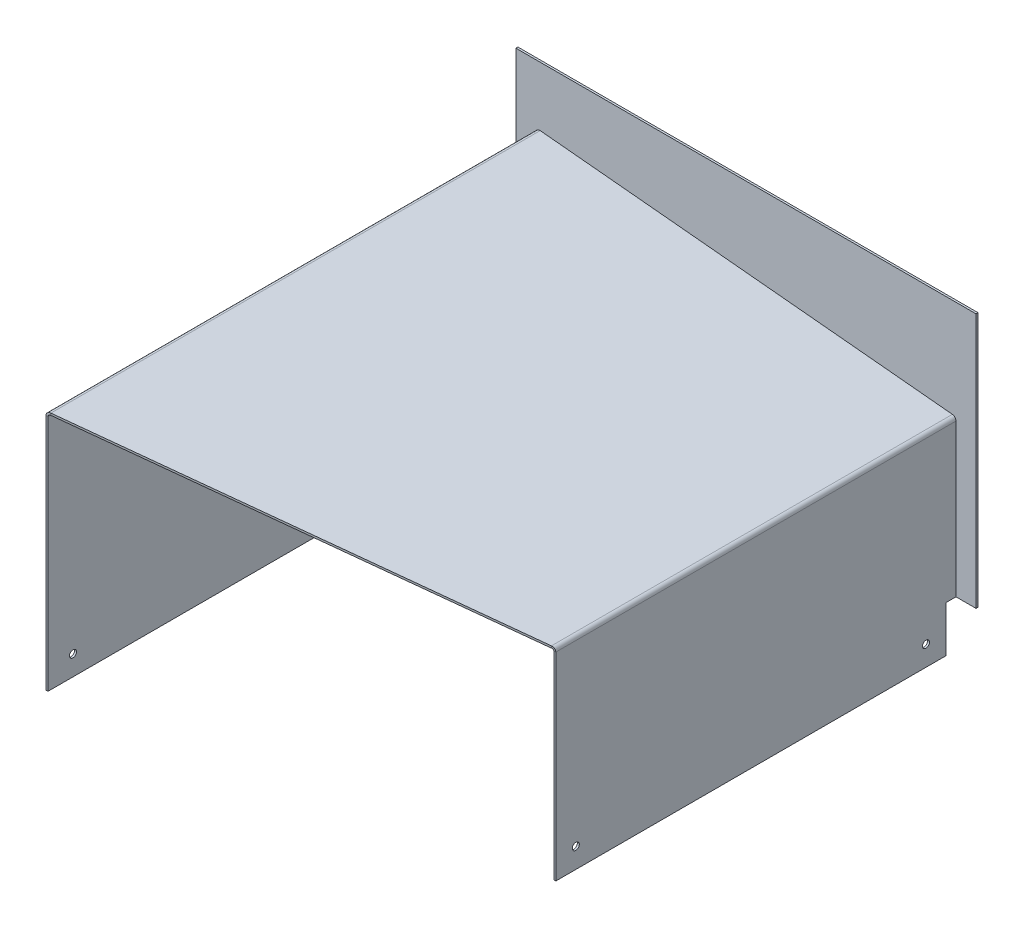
ISO-10303-21;
HEADER;
FILE_DESCRIPTION(('STEP AP214'),'2;1');
FILE_NAME('part.step','',(''),(''),'','','');
FILE_SCHEMA(('AUTOMOTIVE_DESIGN { 1 0 10303 214 1 1 1 1 }'));
ENDSEC;
DATA;
#1=APPLICATION_CONTEXT('core data for automotive mechanical design processes');
#2=APPLICATION_PROTOCOL_DEFINITION('international standard','automotive_design',2000,#1);
#3=PRODUCT_CONTEXT('',#1,'mechanical');
#4=PRODUCT('Part','Part','',(#3));
#5=PRODUCT_RELATED_PRODUCT_CATEGORY('part','',(#4));
#6=PRODUCT_DEFINITION_FORMATION('','',#4);
#7=PRODUCT_DEFINITION_CONTEXT('part definition',#1,'design');
#8=PRODUCT_DEFINITION('design','',#6,#7);
#9=PRODUCT_DEFINITION_SHAPE('','',#8);
#10=(LENGTH_UNIT() NAMED_UNIT(*) SI_UNIT(.MILLI.,.METRE.));
#11=(NAMED_UNIT(*) PLANE_ANGLE_UNIT() SI_UNIT($,.RADIAN.));
#12=(NAMED_UNIT(*) SI_UNIT($,.STERADIAN.) SOLID_ANGLE_UNIT());
#13=UNCERTAINTY_MEASURE_WITH_UNIT(LENGTH_MEASURE(1.E-05),#10,'distance_accuracy_value','');
#14=(GEOMETRIC_REPRESENTATION_CONTEXT(3) GLOBAL_UNCERTAINTY_ASSIGNED_CONTEXT((#13)) GLOBAL_UNIT_ASSIGNED_CONTEXT((#10,
#11,#12)) REPRESENTATION_CONTEXT('',''));
#15=CARTESIAN_POINT('',(0.,0.,0.));
#16=DIRECTION('',(0.,0.,1.));
#17=DIRECTION('',(1.,0.,0.));
#18=AXIS2_PLACEMENT_3D('',#15,#16,#17);
#19=CARTESIAN_POINT('',(416.,200.,490.));
#20=DIRECTION('',(1.,0.,0.));
#21=DIRECTION('',(0.,1.,0.));
#22=AXIS2_PLACEMENT_3D('',#19,#20,#21);
#23=PLANE('',#22);
#24=CARTESIAN_POINT('',(416.,20.0000000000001,380.));
#25=DIRECTION('',(1.,0.,0.));
#26=DIRECTION('',(0.,1.,0.));
#27=AXIS2_PLACEMENT_3D('',#24,#25,#26);
#28=CIRCLE('',#27,3.49999999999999);
#29=CARTESIAN_POINT('',(416.,23.5000000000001,380.));
#30=VERTEX_POINT('',#29);
#31=EDGE_CURVE('E388',#30,#30,#28,.T.);
#32=ORIENTED_EDGE('',*,*,#31,.T.);
#33=EDGE_LOOP('',(#32));
#34=FACE_BOUND('',#33,.T.);
#35=CARTESIAN_POINT('',(416.,20.0000000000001,30.));
#36=DIRECTION('',(1.,0.,0.));
#37=DIRECTION('',(0.,1.,0.));
#38=AXIS2_PLACEMENT_3D('',#35,#36,#37);
#39=CIRCLE('',#38,3.49999999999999);
#40=CARTESIAN_POINT('',(416.,23.5000000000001,30.));
#41=VERTEX_POINT('',#40);
#42=EDGE_CURVE('E391',#41,#41,#39,.T.);
#43=ORIENTED_EDGE('',*,*,#42,.T.);
#44=EDGE_LOOP('',(#43));
#45=FACE_BOUND('',#44,.T.);
#46=DIRECTION('',(0.,0.,1.));
#47=VECTOR('',#46,1.);
#48=CARTESIAN_POINT('',(416.,45.9999999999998,490.));
#49=LINE('',#48,#47);
#50=CARTESIAN_POINT('',(416.,45.9999999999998,-2.));
#51=VERTEX_POINT('',#50);
#52=CARTESIAN_POINT('',(416.,45.9999999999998,10.));
#53=VERTEX_POINT('',#52);
#54=EDGE_CURVE('E290',#51,#53,#49,.T.);
#55=ORIENTED_EDGE('',*,*,#54,.T.);
#56=DIRECTION('',(0.,-1.,0.));
#57=VECTOR('',#56,1.);
#58=CARTESIAN_POINT('',(416.,200.,10.));
#59=LINE('',#58,#57);
#60=CARTESIAN_POINT('',(416.,-2.3215103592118E-13,10.));
#61=VERTEX_POINT('',#60);
#62=EDGE_CURVE('E292',#53,#61,#59,.T.);
#63=ORIENTED_EDGE('',*,*,#62,.T.);
#64=DIRECTION('',(0.,0.,-1.));
#65=VECTOR('',#64,1.);
#66=CARTESIAN_POINT('',(416.,0.,490.));
#67=LINE('',#66,#65);
#68=CARTESIAN_POINT('',(416.,9.43689570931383E-13,400.));
#69=VERTEX_POINT('',#68);
#70=EDGE_CURVE('E42',#69,#61,#67,.T.);
#71=ORIENTED_EDGE('',*,*,#70,.F.);
#72=DIRECTION('',(0.,1.,0.));
#73=VECTOR('',#72,1.);
#74=CARTESIAN_POINT('',(416.,200.,400.));
#75=LINE('',#74,#73);
#76=CARTESIAN_POINT('',(416.,198.18308340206,400.));
#77=VERTEX_POINT('',#76);
#78=EDGE_CURVE('E208',#77,#69,#75,.F.);
#79=ORIENTED_EDGE('',*,*,#78,.F.);
#80=DIRECTION('',(0.,0.,-1.));
#81=VECTOR('',#80,1.);
#82=CARTESIAN_POINT('',(416.,198.18308340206,490.));
#83=LINE('',#82,#81);
#84=CARTESIAN_POINT('',(416.,198.18308340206,-2.));
#85=VERTEX_POINT('',#84);
#86=EDGE_CURVE('E202',#77,#85,#83,.T.);
#87=ORIENTED_EDGE('',*,*,#86,.T.);
#88=DIRECTION('',(0.,1.,0.));
#89=VECTOR('',#88,1.);
#90=CARTESIAN_POINT('',(416.,198.18308340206,-2.));
#91=LINE('',#90,#89);
#92=EDGE_CURVE('E206',#51,#85,#91,.T.);
#93=ORIENTED_EDGE('',*,*,#92,.F.);
#94=EDGE_LOOP('',(#55,#63,#71,#79,#87,#93));
#95=FACE_BOUND('',#94,.T.);
#96=ADVANCED_FACE('F35',(#34,#45,#95),#23,.F.);
#97=CARTESIAN_POINT('',(418.,0.,490.));
#98=DIRECTION('',(0.,-1.,0.));
#99=DIRECTION('',(1.,0.,0.));
#100=AXIS2_PLACEMENT_3D('',#97,#98,#99);
#101=PLANE('',#100);
#102=DIRECTION('',(1.,0.,0.));
#103=VECTOR('',#102,1.);
#104=CARTESIAN_POINT('',(-2.00000000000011,0.,10.));
#105=LINE('',#104,#103);
#106=CARTESIAN_POINT('',(418.,-2.33261258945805E-13,10.));
#107=VERTEX_POINT('',#106);
#108=EDGE_CURVE('E285',#61,#107,#105,.T.);
#109=ORIENTED_EDGE('',*,*,#108,.T.);
#110=DIRECTION('',(0.,0.,-1.));
#111=VECTOR('',#110,1.);
#112=CARTESIAN_POINT('',(418.,0.,490.));
#113=LINE('',#112,#111);
#114=CARTESIAN_POINT('',(418.,9.54261476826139E-13,400.));
#115=VERTEX_POINT('',#114);
#116=EDGE_CURVE('E437',#115,#107,#113,.T.);
#117=ORIENTED_EDGE('',*,*,#116,.F.);
#118=DIRECTION('',(1.,0.,0.));
#119=VECTOR('',#118,1.);
#120=CARTESIAN_POINT('',(418.,9.54261476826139E-13,400.));
#121=LINE('',#120,#119);
#122=EDGE_CURVE('E67',#115,#69,#121,.F.);
#123=ORIENTED_EDGE('',*,*,#122,.T.);
#124=ORIENTED_EDGE('',*,*,#70,.T.);
#125=EDGE_LOOP('',(#109,#117,#123,#124));
#126=FACE_BOUND('',#125,.T.);
#127=ADVANCED_FACE('F378',(#126),#101,.T.);
#128=CARTESIAN_POINT('',(418.,200.,490.));
#129=DIRECTION('',(1.,0.,0.));
#130=DIRECTION('',(0.,1.,0.));
#131=AXIS2_PLACEMENT_3D('',#128,#129,#130);
#132=PLANE('',#131);
#133=DIRECTION('',(0.,-1.,0.));
#134=VECTOR('',#133,1.);
#135=CARTESIAN_POINT('',(418.,-2.33261258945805E-13,10.));
#136=LINE('',#135,#134);
#137=CARTESIAN_POINT('',(418.,45.9999999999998,10.));
#138=VERTEX_POINT('',#137);
#139=EDGE_CURVE('E274',#138,#107,#136,.T.);
#140=ORIENTED_EDGE('',*,*,#139,.F.);
#141=DIRECTION('',(0.,0.,1.));
#142=VECTOR('',#141,1.);
#143=CARTESIAN_POINT('',(418.,45.9999999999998,0.));
#144=LINE('',#143,#142);
#145=CARTESIAN_POINT('',(418.,45.9999999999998,0.));
#146=VERTEX_POINT('',#145);
#147=EDGE_CURVE('E269',#146,#138,#144,.T.);
#148=ORIENTED_EDGE('',*,*,#147,.F.);
#149=DIRECTION('',(0.,-1.,0.));
#150=VECTOR('',#149,1.);
#151=CARTESIAN_POINT('',(418.,200.,0.));
#152=LINE('',#151,#150);
#153=CARTESIAN_POINT('',(418.,198.18308340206,0.));
#154=VERTEX_POINT('',#153);
#155=EDGE_CURVE('E404',#154,#146,#152,.T.);
#156=ORIENTED_EDGE('',*,*,#155,.F.);
#157=DIRECTION('',(0.,0.,-1.));
#158=VECTOR('',#157,1.);
#159=CARTESIAN_POINT('',(418.,198.18308340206,490.));
#160=LINE('',#159,#158);
#161=CARTESIAN_POINT('',(417.999999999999,198.18308340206,400.));
#162=VERTEX_POINT('',#161);
#163=EDGE_CURVE('E434',#162,#154,#160,.T.);
#164=ORIENTED_EDGE('',*,*,#163,.F.);
#165=DIRECTION('',(0.,-1.,0.));
#166=VECTOR('',#165,1.);
#167=CARTESIAN_POINT('',(417.999999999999,241.798468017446,400.));
#168=LINE('',#167,#166);
#169=EDGE_CURVE('E450',#162,#115,#168,.T.);
#170=ORIENTED_EDGE('',*,*,#169,.T.);
#171=ORIENTED_EDGE('',*,*,#116,.T.);
#172=EDGE_LOOP('',(#140,#148,#156,#164,#170,#171));
#173=FACE_BOUND('',#172,.T.);
#174=CARTESIAN_POINT('',(418.,20.0000000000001,380.));
#175=DIRECTION('',(1.,0.,0.));
#176=DIRECTION('',(0.,0.,-1.));
#177=AXIS2_PLACEMENT_3D('',#174,#175,#176);
#178=CIRCLE('',#177,3.49999999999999);
#179=CARTESIAN_POINT('',(418.,20.0000000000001,376.5));
#180=VERTEX_POINT('',#179);
#181=EDGE_CURVE('E393',#180,#180,#178,.T.);
#182=ORIENTED_EDGE('',*,*,#181,.F.);
#183=EDGE_LOOP('',(#182));
#184=FACE_BOUND('',#183,.T.);
#185=CARTESIAN_POINT('',(418.,20.0000000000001,30.));
#186=DIRECTION('',(1.,0.,0.));
#187=DIRECTION('',(0.,0.,-1.));
#188=AXIS2_PLACEMENT_3D('',#185,#186,#187);
#189=CIRCLE('',#188,3.49999999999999);
#190=CARTESIAN_POINT('',(418.,20.0000000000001,26.5));
#191=VERTEX_POINT('',#190);
#192=EDGE_CURVE('E394',#191,#191,#189,.T.);
#193=ORIENTED_EDGE('',*,*,#192,.F.);
#194=EDGE_LOOP('',(#193));
#195=FACE_BOUND('',#194,.T.);
#196=ADVANCED_FACE('F383',(#173,#184,#195),#132,.T.);
#197=CARTESIAN_POINT('',(414.,198.18308340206,490.));
#198=DIRECTION('',(0.,0.,-1.));
#199=DIRECTION('',(-1.,0.,0.));
#200=AXIS2_PLACEMENT_3D('',#197,#198,#199);
#201=CYLINDRICAL_SURFACE('',#200,4.);
#202=DIRECTION('',(0.,0.,-1.));
#203=VECTOR('',#202,1.);
#204=CARTESIAN_POINT('',(414.382849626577,202.164719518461,490.));
#205=LINE('',#204,#203);
#206=CARTESIAN_POINT('',(414.382849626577,202.164719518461,400.775103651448));
#207=VERTEX_POINT('',#206);
#208=CARTESIAN_POINT('',(414.382849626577,202.164719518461,0.));
#209=VERTEX_POINT('',#208);
#210=EDGE_CURVE('E431',#207,#209,#205,.T.);
#211=ORIENTED_EDGE('',*,*,#210,.F.);
#212=CARTESIAN_POINT('',(414.,198.18308340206,400.857142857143));
#213=DIRECTION('',(-0.209529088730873,0.,-0.97780241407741));
#214=DIRECTION('',(0.97780241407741,0.,-0.209529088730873));
#215=AXIS2_PLACEMENT_3D('',#212,#213,#214);
#216=ELLIPSE('',#215,4.09080601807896,4.);
#217=EDGE_CURVE('E295',#162,#207,#216,.F.);
#218=ORIENTED_EDGE('',*,*,#217,.F.);
#219=ORIENTED_EDGE('',*,*,#163,.T.);
#220=CARTESIAN_POINT('',(414.,198.18308340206,0.));
#221=DIRECTION('',(0.,0.,1.));
#222=DIRECTION('',(1.,0.,0.));
#223=AXIS2_PLACEMENT_3D('',#220,#221,#222);
#224=CIRCLE('',#223,4.);
#225=EDGE_CURVE('E407',#209,#154,#224,.F.);
#226=ORIENTED_EDGE('',*,*,#225,.F.);
#227=EDGE_LOOP('',(#211,#218,#219,#226));
#228=FACE_BOUND('',#227,.T.);
#229=ADVANCED_FACE('F470',(#228),#201,.T.);
#230=CARTESIAN_POINT('',(416.191424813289,201.990818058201,490.));
#231=DIRECTION('',(0.0957124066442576,0.995409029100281,0.));
#232=DIRECTION('',(-0.995409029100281,0.0957124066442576,0.));
#233=AXIS2_PLACEMENT_3D('',#230,#231,#232);
#234=PLANE('',#233);
#235=DIRECTION('',(0.,0.,-1.));
#236=VECTOR('',#235,1.);
#237=CARTESIAN_POINT('',(2.3828496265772,241.780104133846,490.));
#238=LINE('',#237,#236);
#239=CARTESIAN_POINT('',(2.3828496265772,241.780104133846,489.060817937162));
#240=VERTEX_POINT('',#239);
#241=CARTESIAN_POINT('',(2.3828496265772,241.780104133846,0.));
#242=VERTEX_POINT('',#241);
#243=EDGE_CURVE('E428',#240,#242,#238,.T.);
#244=ORIENTED_EDGE('',*,*,#243,.F.);
#245=DIRECTION('',(-0.973509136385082,0.0936066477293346,0.208609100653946));
#246=VECTOR('',#245,1.);
#247=CARTESIAN_POINT('',(397.992672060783,203.740698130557,404.287284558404));
#248=LINE('',#247,#246);
#249=EDGE_CURVE('E74',#207,#240,#248,.T.);
#250=ORIENTED_EDGE('',*,*,#249,.F.);
#251=ORIENTED_EDGE('',*,*,#210,.T.);
#252=DIRECTION('',(0.995409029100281,-0.0957124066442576,0.));
#253=VECTOR('',#252,1.);
#254=CARTESIAN_POINT('',(416.191424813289,201.990818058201,0.));
#255=LINE('',#254,#253);
#256=EDGE_CURVE('E409',#242,#209,#255,.T.);
#257=ORIENTED_EDGE('',*,*,#256,.F.);
#258=EDGE_LOOP('',(#244,#250,#251,#257));
#259=FACE_BOUND('',#258,.T.);
#260=ADVANCED_FACE('F466',(#259),#234,.T.);
#261=CARTESIAN_POINT('',(2.,237.798468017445,490.));
#262=DIRECTION('',(0.,0.,-1.));
#263=DIRECTION('',(-1.,0.,0.));
#264=AXIS2_PLACEMENT_3D('',#261,#262,#263);
#265=CYLINDRICAL_SURFACE('',#264,4.);
#266=DIRECTION('',(0.,0.,-1.));
#267=VECTOR('',#266,1.);
#268=CARTESIAN_POINT('',(-2.,237.798468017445,490.));
#269=LINE('',#268,#267);
#270=CARTESIAN_POINT('',(-2.,237.798468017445,489.571428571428));
#271=VERTEX_POINT('',#270);
#272=CARTESIAN_POINT('',(-2.,237.798468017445,0.));
#273=VERTEX_POINT('',#272);
#274=EDGE_CURVE('E425',#271,#273,#269,.T.);
#275=ORIENTED_EDGE('',*,*,#274,.F.);
#276=CARTESIAN_POINT('',(2.,237.798468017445,489.142857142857));
#277=DIRECTION('',(-0.106533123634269,0.,-0.994309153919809));
#278=DIRECTION('',(0.994309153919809,0.,-0.106533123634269));
#279=AXIS2_PLACEMENT_3D('',#276,#277,#278);
#280=ELLIPSE('',#279,4.02289366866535,4.);
#281=CARTESIAN_POINT('',(2.00000000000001,241.798468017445,489.142857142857));
#282=VERTEX_POINT('',#281);
#283=EDGE_CURVE('E310',#282,#271,#280,.F.);
#284=ORIENTED_EDGE('',*,*,#283,.F.);
#285=CARTESIAN_POINT('',(2.,237.798468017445,489.142857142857));
#286=DIRECTION('',(-0.209529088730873,0.,-0.97780241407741));
#287=DIRECTION('',(0.97780241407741,0.,-0.209529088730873));
#288=AXIS2_PLACEMENT_3D('',#285,#286,#287);
#289=ELLIPSE('',#288,4.09080601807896,4.);
#290=EDGE_CURVE('E99',#240,#282,#289,.F.);
#291=ORIENTED_EDGE('',*,*,#290,.F.);
#292=ORIENTED_EDGE('',*,*,#243,.T.);
#293=CARTESIAN_POINT('',(2.,237.798468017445,0.));
#294=DIRECTION('',(0.,0.,1.));
#295=DIRECTION('',(1.,0.,0.));
#296=AXIS2_PLACEMENT_3D('',#293,#294,#295);
#297=CIRCLE('',#296,4.);
#298=EDGE_CURVE('E411',#273,#242,#297,.F.);
#299=ORIENTED_EDGE('',*,*,#298,.F.);
#300=EDGE_LOOP('',(#275,#284,#291,#292,#299));
#301=FACE_BOUND('',#300,.T.);
#302=ADVANCED_FACE('F475',(#301),#265,.T.);
#303=CARTESIAN_POINT('',(-2.,0.,490.));
#304=DIRECTION('',(-1.,0.,0.));
#305=DIRECTION('',(0.,0.,1.));
#306=AXIS2_PLACEMENT_3D('',#303,#304,#305);
#307=PLANE('',#306);
#308=CARTESIAN_POINT('',(-2.,20.0000000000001,464.571428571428));
#309=DIRECTION('',(-1.,0.,0.));
#310=DIRECTION('',(0.,0.,1.));
#311=AXIS2_PLACEMENT_3D('',#308,#309,#310);
#312=CIRCLE('',#311,3.49999999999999);
#313=CARTESIAN_POINT('',(-2.,20.0000000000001,468.071428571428));
#314=VERTEX_POINT('',#313);
#315=EDGE_CURVE('E803',#314,#314,#312,.T.);
#316=ORIENTED_EDGE('',*,*,#315,.F.);
#317=EDGE_LOOP('',(#316));
#318=FACE_BOUND('',#317,.T.);
#319=CARTESIAN_POINT('',(-2.,20.0000000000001,30.));
#320=DIRECTION('',(-1.,0.,0.));
#321=DIRECTION('',(0.,0.,1.));
#322=AXIS2_PLACEMENT_3D('',#319,#320,#321);
#323=CIRCLE('',#322,3.49999999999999);
#324=CARTESIAN_POINT('',(-2.,20.0000000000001,33.5));
#325=VERTEX_POINT('',#324);
#326=EDGE_CURVE('E806',#325,#325,#323,.T.);
#327=ORIENTED_EDGE('',*,*,#326,.F.);
#328=EDGE_LOOP('',(#327));
#329=FACE_BOUND('',#328,.T.);
#330=DIRECTION('',(0.,-1.,0.));
#331=VECTOR('',#330,1.);
#332=CARTESIAN_POINT('',(-2.00000000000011,0.,10.));
#333=LINE('',#332,#331);
#334=CARTESIAN_POINT('',(-2.00000000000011,46.,10.));
#335=VERTEX_POINT('',#334);
#336=CARTESIAN_POINT('',(-2.00000000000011,0.,10.));
#337=VERTEX_POINT('',#336);
#338=EDGE_CURVE('E273',#335,#337,#333,.T.);
#339=ORIENTED_EDGE('',*,*,#338,.T.);
#340=DIRECTION('',(0.,0.,-1.));
#341=VECTOR('',#340,1.);
#342=CARTESIAN_POINT('',(-2.,0.,490.));
#343=LINE('',#342,#341);
#344=CARTESIAN_POINT('',(-2.,0.,489.571428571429));
#345=VERTEX_POINT('',#344);
#346=EDGE_CURVE('E422',#345,#337,#343,.T.);
#347=ORIENTED_EDGE('',*,*,#346,.F.);
#348=DIRECTION('',(0.,1.,0.));
#349=VECTOR('',#348,1.);
#350=CARTESIAN_POINT('',(-2.,0.,489.571428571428));
#351=LINE('',#350,#349);
#352=EDGE_CURVE('E83',#271,#345,#351,.F.);
#353=ORIENTED_EDGE('',*,*,#352,.F.);
#354=ORIENTED_EDGE('',*,*,#274,.T.);
#355=DIRECTION('',(0.,1.,0.));
#356=VECTOR('',#355,1.);
#357=CARTESIAN_POINT('',(-2.,0.,0.));
#358=LINE('',#357,#356);
#359=CARTESIAN_POINT('',(-2.00000000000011,46.,0.));
#360=VERTEX_POINT('',#359);
#361=EDGE_CURVE('E211',#360,#273,#358,.T.);
#362=ORIENTED_EDGE('',*,*,#361,.F.);
#363=DIRECTION('',(0.,0.,1.));
#364=VECTOR('',#363,1.);
#365=CARTESIAN_POINT('',(-2.00000000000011,46.,0.));
#366=LINE('',#365,#364);
#367=EDGE_CURVE('E270',#360,#335,#366,.T.);
#368=ORIENTED_EDGE('',*,*,#367,.T.);
#369=EDGE_LOOP('',(#339,#347,#353,#354,#362,#368));
#370=FACE_BOUND('',#369,.T.);
#371=ADVANCED_FACE('F502',(#318,#329,#370),#307,.T.);
#372=CARTESIAN_POINT('',(0.,0.,490.));
#373=DIRECTION('',(0.,-1.,0.));
#374=DIRECTION('',(0.,0.,-1.));
#375=AXIS2_PLACEMENT_3D('',#372,#373,#374);
#376=PLANE('',#375);
#377=CARTESIAN_POINT('',(0.,0.,10.));
#378=VERTEX_POINT('',#377);
#379=EDGE_CURVE('E281',#337,#378,#105,.T.);
#380=ORIENTED_EDGE('',*,*,#379,.T.);
#381=DIRECTION('',(0.,0.,-1.));
#382=VECTOR('',#381,1.);
#383=CARTESIAN_POINT('',(0.,0.,490.));
#384=LINE('',#383,#382);
#385=CARTESIAN_POINT('',(0.,0.,489.571428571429));
#386=VERTEX_POINT('',#385);
#387=EDGE_CURVE('E419',#386,#378,#384,.T.);
#388=ORIENTED_EDGE('',*,*,#387,.F.);
#389=DIRECTION('',(1.,0.,0.));
#390=VECTOR('',#389,1.);
#391=CARTESIAN_POINT('',(0.,0.,489.571428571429));
#392=LINE('',#391,#390);
#393=EDGE_CURVE('E92',#386,#345,#392,.F.);
#394=ORIENTED_EDGE('',*,*,#393,.T.);
#395=ORIENTED_EDGE('',*,*,#346,.T.);
#396=EDGE_LOOP('',(#380,#388,#394,#395));
#397=FACE_BOUND('',#396,.T.);
#398=ADVANCED_FACE('F513',(#397),#376,.T.);
#399=CARTESIAN_POINT('',(0.,0.,490.));
#400=DIRECTION('',(-1.,0.,0.));
#401=DIRECTION('',(0.,0.,1.));
#402=AXIS2_PLACEMENT_3D('',#399,#400,#401);
#403=PLANE('',#402);
#404=CARTESIAN_POINT('',(0.,20.0000000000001,464.571428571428));
#405=DIRECTION('',(-1.,0.,0.));
#406=DIRECTION('',(0.,0.,1.));
#407=AXIS2_PLACEMENT_3D('',#404,#405,#406);
#408=CIRCLE('',#407,3.49999999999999);
#409=CARTESIAN_POINT('',(0.,20.0000000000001,468.071428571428));
#410=VERTEX_POINT('',#409);
#411=EDGE_CURVE('E808',#410,#410,#408,.T.);
#412=ORIENTED_EDGE('',*,*,#411,.T.);
#413=EDGE_LOOP('',(#412));
#414=FACE_BOUND('',#413,.T.);
#415=CARTESIAN_POINT('',(0.,20.0000000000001,30.));
#416=DIRECTION('',(-1.,0.,0.));
#417=DIRECTION('',(0.,0.,1.));
#418=AXIS2_PLACEMENT_3D('',#415,#416,#417);
#419=CIRCLE('',#418,3.49999999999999);
#420=CARTESIAN_POINT('',(0.,20.0000000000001,33.5));
#421=VERTEX_POINT('',#420);
#422=EDGE_CURVE('E231',#421,#421,#419,.T.);
#423=ORIENTED_EDGE('',*,*,#422,.T.);
#424=EDGE_LOOP('',(#423));
#425=FACE_BOUND('',#424,.T.);
#426=ORIENTED_EDGE('',*,*,#387,.T.);
#427=DIRECTION('',(0.,1.,0.));
#428=VECTOR('',#427,1.);
#429=CARTESIAN_POINT('',(0.,0.,10.));
#430=LINE('',#429,#428);
#431=CARTESIAN_POINT('',(0.,46.,10.));
#432=VERTEX_POINT('',#431);
#433=EDGE_CURVE('E11',#378,#432,#430,.T.);
#434=ORIENTED_EDGE('',*,*,#433,.T.);
#435=DIRECTION('',(0.,0.,-1.));
#436=VECTOR('',#435,1.);
#437=CARTESIAN_POINT('',(0.,46.,490.));
#438=LINE('',#437,#436);
#439=CARTESIAN_POINT('',(0.,46.,-2.));
#440=VERTEX_POINT('',#439);
#441=EDGE_CURVE('E284',#432,#440,#438,.T.);
#442=ORIENTED_EDGE('',*,*,#441,.T.);
#443=DIRECTION('',(0.,-1.,0.));
#444=VECTOR('',#443,1.);
#445=CARTESIAN_POINT('',(0.,46.,-2.));
#446=LINE('',#445,#444);
#447=CARTESIAN_POINT('',(0.,237.798468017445,-2.));
#448=VERTEX_POINT('',#447);
#449=EDGE_CURVE('E238',#448,#440,#446,.T.);
#450=ORIENTED_EDGE('',*,*,#449,.F.);
#451=DIRECTION('',(0.,0.,-1.));
#452=VECTOR('',#451,1.);
#453=CARTESIAN_POINT('',(0.,237.798468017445,490.));
#454=LINE('',#453,#452);
#455=CARTESIAN_POINT('',(0.,237.798468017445,489.571428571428));
#456=VERTEX_POINT('',#455);
#457=EDGE_CURVE('E417',#456,#448,#454,.T.);
#458=ORIENTED_EDGE('',*,*,#457,.F.);
#459=DIRECTION('',(0.,-1.,0.));
#460=VECTOR('',#459,1.);
#461=CARTESIAN_POINT('',(0.,0.,489.571428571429));
#462=LINE('',#461,#460);
#463=EDGE_CURVE('E477',#456,#386,#462,.T.);
#464=ORIENTED_EDGE('',*,*,#463,.T.);
#465=EDGE_LOOP('',(#426,#434,#442,#450,#458,#464));
#466=FACE_BOUND('',#465,.T.);
#467=ADVANCED_FACE('F494',(#414,#425,#466),#403,.F.);
#468=CARTESIAN_POINT('',(2.,237.798468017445,490.));
#469=DIRECTION('',(0.,0.,-1.));
#470=DIRECTION('',(-1.,0.,0.));
#471=AXIS2_PLACEMENT_3D('',#468,#469,#470);
#472=CYLINDRICAL_SURFACE('',#471,2.);
#473=CARTESIAN_POINT('',(2.,237.798468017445,489.142857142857));
#474=DIRECTION('',(-0.209529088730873,0.,-0.97780241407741));
#475=DIRECTION('',(0.97780241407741,0.,-0.209529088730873));
#476=AXIS2_PLACEMENT_3D('',#473,#474,#475);
#477=ELLIPSE('',#476,2.04540300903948,2.);
#478=CARTESIAN_POINT('',(2.00000000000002,239.798468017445,489.142857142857));
#479=VERTEX_POINT('',#478);
#480=EDGE_CURVE('E309',#479,#456,#477,.F.);
#481=ORIENTED_EDGE('',*,*,#480,.T.);
#482=ORIENTED_EDGE('',*,*,#457,.T.);
#483=CARTESIAN_POINT('',(2.,237.798468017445,-2.));
#484=DIRECTION('',(0.,0.,1.));
#485=DIRECTION('',(-1.,0.,0.));
#486=AXIS2_PLACEMENT_3D('',#483,#484,#485);
#487=CIRCLE('',#486,2.);
#488=CARTESIAN_POINT('',(2.19142481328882,239.789286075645,-2.));
#489=VERTEX_POINT('',#488);
#490=EDGE_CURVE('E235',#489,#448,#487,.T.);
#491=ORIENTED_EDGE('',*,*,#490,.F.);
#492=DIRECTION('',(0.,0.,-1.));
#493=VECTOR('',#492,1.);
#494=CARTESIAN_POINT('',(2.19142481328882,239.789286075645,490.));
#495=LINE('',#494,#493);
#496=CARTESIAN_POINT('',(2.1914248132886,239.789286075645,489.060817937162));
#497=VERTEX_POINT('',#496);
#498=EDGE_CURVE('E415',#497,#489,#495,.T.);
#499=ORIENTED_EDGE('',*,*,#498,.F.);
#500=CARTESIAN_POINT('',(2.,237.798468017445,489.142857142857));
#501=DIRECTION('',(-0.393919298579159,0.,-0.919145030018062));
#502=DIRECTION('',(0.919145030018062,0.,-0.393919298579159));
#503=AXIS2_PLACEMENT_3D('',#500,#501,#502);
#504=ELLIPSE('',#503,2.17593517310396,2.);
#505=EDGE_CURVE('E298',#497,#479,#504,.F.);
#506=ORIENTED_EDGE('',*,*,#505,.T.);
#507=EDGE_LOOP('',(#481,#482,#491,#499,#506));
#508=FACE_BOUND('',#507,.T.);
#509=ADVANCED_FACE('F490',(#508),#472,.F.);
#510=CARTESIAN_POINT('',(416.,200.,490.));
#511=DIRECTION('',(0.0957124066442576,0.995409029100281,0.));
#512=DIRECTION('',(-0.995409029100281,0.0957124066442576,0.));
#513=AXIS2_PLACEMENT_3D('',#510,#511,#512);
#514=PLANE('',#513);
#515=DIRECTION('',(-0.973509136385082,0.0936066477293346,0.208609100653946));
#516=VECTOR('',#515,1.);
#517=CARTESIAN_POINT('',(397.801247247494,201.749880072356,404.287284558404));
#518=LINE('',#517,#516);
#519=CARTESIAN_POINT('',(414.191424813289,200.173901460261,400.775103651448));
#520=VERTEX_POINT('',#519);
#521=EDGE_CURVE('E463',#520,#497,#518,.T.);
#522=ORIENTED_EDGE('',*,*,#521,.T.);
#523=ORIENTED_EDGE('',*,*,#498,.T.);
#524=DIRECTION('',(-0.995409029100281,0.0957124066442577,0.));
#525=VECTOR('',#524,1.);
#526=CARTESIAN_POINT('',(2.19142481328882,239.789286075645,-2.));
#527=LINE('',#526,#525);
#528=CARTESIAN_POINT('',(414.191424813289,200.173901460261,-2.));
#529=VERTEX_POINT('',#528);
#530=EDGE_CURVE('E220',#529,#489,#527,.T.);
#531=ORIENTED_EDGE('',*,*,#530,.F.);
#532=DIRECTION('',(0.,0.,-1.));
#533=VECTOR('',#532,1.);
#534=CARTESIAN_POINT('',(414.191424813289,200.173901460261,490.));
#535=LINE('',#534,#533);
#536=EDGE_CURVE('E210',#520,#529,#535,.T.);
#537=ORIENTED_EDGE('',*,*,#536,.F.);
#538=EDGE_LOOP('',(#522,#523,#531,#537));
#539=FACE_BOUND('',#538,.T.);
#540=ADVANCED_FACE('F488',(#539),#514,.F.);
#541=CARTESIAN_POINT('',(414.,198.18308340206,490.));
#542=DIRECTION('',(0.,0.,-1.));
#543=DIRECTION('',(-1.,0.,0.));
#544=AXIS2_PLACEMENT_3D('',#541,#542,#543);
#545=CYLINDRICAL_SURFACE('',#544,2.);
#546=CARTESIAN_POINT('',(414.,198.18308340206,400.857142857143));
#547=DIRECTION('',(-0.393919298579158,0.,-0.919145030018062));
#548=DIRECTION('',(0.919145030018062,0.,-0.393919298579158));
#549=AXIS2_PLACEMENT_3D('',#546,#547,#548);
#550=ELLIPSE('',#549,2.17593517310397,2.);
#551=EDGE_CURVE('E55',#77,#520,#550,.F.);
#552=ORIENTED_EDGE('',*,*,#551,.T.);
#553=ORIENTED_EDGE('',*,*,#536,.T.);
#554=CARTESIAN_POINT('',(414.,198.18308340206,-2.));
#555=DIRECTION('',(0.,0.,1.));
#556=DIRECTION('',(-1.,0.,0.));
#557=AXIS2_PLACEMENT_3D('',#554,#555,#556);
#558=CIRCLE('',#557,2.);
#559=EDGE_CURVE('E214',#85,#529,#558,.T.);
#560=ORIENTED_EDGE('',*,*,#559,.F.);
#561=ORIENTED_EDGE('',*,*,#86,.F.);
#562=EDGE_LOOP('',(#552,#553,#560,#561));
#563=FACE_BOUND('',#562,.T.);
#564=ADVANCED_FACE('F215',(#563),#545,.F.);
#565=CARTESIAN_POINT('',(418.,20.0000000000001,380.));
#566=DIRECTION('',(1.,0.,0.));
#567=DIRECTION('',(0.,0.,-1.));
#568=AXIS2_PLACEMENT_3D('',#565,#566,#567);
#569=CYLINDRICAL_SURFACE('',#568,3.49999999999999);
#570=ORIENTED_EDGE('',*,*,#31,.F.);
#571=EDGE_LOOP('',(#570));
#572=FACE_BOUND('',#571,.T.);
#573=ORIENTED_EDGE('',*,*,#181,.T.);
#574=EDGE_LOOP('',(#573));
#575=FACE_BOUND('',#574,.T.);
#576=ADVANCED_FACE('F528',(#572,#575),#569,.F.);
#577=CARTESIAN_POINT('',(418.,20.0000000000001,30.));
#578=DIRECTION('',(1.,0.,0.));
#579=DIRECTION('',(0.,0.,-1.));
#580=AXIS2_PLACEMENT_3D('',#577,#578,#579);
#581=CYLINDRICAL_SURFACE('',#580,3.49999999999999);
#582=ORIENTED_EDGE('',*,*,#42,.F.);
#583=EDGE_LOOP('',(#582));
#584=FACE_BOUND('',#583,.T.);
#585=ORIENTED_EDGE('',*,*,#192,.T.);
#586=EDGE_LOOP('',(#585));
#587=FACE_BOUND('',#586,.T.);
#588=ADVANCED_FACE('F525',(#584,#587),#581,.F.);
#589=CARTESIAN_POINT('',(417.999999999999,241.798468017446,400.));
#590=DIRECTION('',(0.,0.,1.));
#591=DIRECTION('',(0.,-1.,0.));
#592=AXIS2_PLACEMENT_3D('',#589,#590,#591);
#593=PLANE('',#592);
#594=ORIENTED_EDGE('',*,*,#169,.F.);
#595=DIRECTION('',(1.,0.,0.));
#596=VECTOR('',#595,1.);
#597=CARTESIAN_POINT('',(417.999999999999,198.18308340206,400.));
#598=LINE('',#597,#596);
#599=EDGE_CURVE('E399',#162,#77,#598,.F.);
#600=ORIENTED_EDGE('',*,*,#599,.T.);
#601=ORIENTED_EDGE('',*,*,#78,.T.);
#602=ORIENTED_EDGE('',*,*,#122,.F.);
#603=EDGE_LOOP('',(#594,#600,#601,#602));
#604=FACE_BOUND('',#603,.T.);
#605=ADVANCED_FACE('F458',(#604),#593,.T.);
#606=CARTESIAN_POINT('',(397.992672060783,203.740698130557,404.287284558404));
#607=DIRECTION('',(-0.207651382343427,0.0199664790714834,-0.977999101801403));
#608=DIRECTION('',(-0.973509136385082,0.0936066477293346,0.208609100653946));
#609=AXIS2_PLACEMENT_3D('',#606,#607,#608);
#610=PLANE('',#609);
#611=ORIENTED_EDGE('',*,*,#249,.T.);
#612=DIRECTION('',(0.0957124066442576,0.995409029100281,0.));
#613=VECTOR('',#612,1.);
#614=CARTESIAN_POINT('',(2.3828496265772,241.780104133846,489.060817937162));
#615=LINE('',#614,#613);
#616=EDGE_CURVE('E452',#240,#497,#615,.F.);
#617=ORIENTED_EDGE('',*,*,#616,.T.);
#618=ORIENTED_EDGE('',*,*,#521,.F.);
#619=DIRECTION('',(0.0957124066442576,0.995409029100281,0.));
#620=VECTOR('',#619,1.);
#621=CARTESIAN_POINT('',(414.382849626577,202.164719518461,400.775103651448));
#622=LINE('',#621,#620);
#623=EDGE_CURVE('E49',#207,#520,#622,.F.);
#624=ORIENTED_EDGE('',*,*,#623,.F.);
#625=EDGE_LOOP('',(#611,#617,#618,#624));
#626=FACE_BOUND('',#625,.T.);
#627=ADVANCED_FACE('F461',(#626),#610,.F.);
#628=CARTESIAN_POINT('',(0.,0.,489.571428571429));
#629=DIRECTION('',(0.,0.,-1.));
#630=DIRECTION('',(0.,-1.,0.));
#631=AXIS2_PLACEMENT_3D('',#628,#629,#630);
#632=PLANE('',#631);
#633=ORIENTED_EDGE('',*,*,#393,.F.);
#634=ORIENTED_EDGE('',*,*,#463,.F.);
#635=DIRECTION('',(1.,0.,0.));
#636=VECTOR('',#635,1.);
#637=CARTESIAN_POINT('',(0.,237.798468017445,489.571428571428));
#638=LINE('',#637,#636);
#639=EDGE_CURVE('E105',#456,#271,#638,.F.);
#640=ORIENTED_EDGE('',*,*,#639,.T.);
#641=ORIENTED_EDGE('',*,*,#352,.T.);
#642=EDGE_LOOP('',(#633,#634,#640,#641));
#643=FACE_BOUND('',#642,.T.);
#644=ADVANCED_FACE('F515',(#643),#632,.F.);
#645=CARTESIAN_POINT('',(6.,237.798468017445,488.714285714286));
#646=CARTESIAN_POINT('',(5.33333333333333,237.798468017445,488.714285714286));
#647=CARTESIAN_POINT('',(4.66666666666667,237.798468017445,488.714285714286));
#648=CARTESIAN_POINT('',(4.,237.798468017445,488.714285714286));
#649=CARTESIAN_POINT('',(6.,245.798468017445,488.714285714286));
#650=CARTESIAN_POINT('',(5.33333333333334,244.465134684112,488.714285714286));
#651=CARTESIAN_POINT('',(4.66666666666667,243.131801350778,488.714285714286));
#652=CARTESIAN_POINT('',(4.,241.798468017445,488.714285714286));
#653=CARTESIAN_POINT('',(-2.,245.798468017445,489.571428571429));
#654=CARTESIAN_POINT('',(-1.33333333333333,244.465134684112,489.571428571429));
#655=CARTESIAN_POINT('',(-0.666666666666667,243.131801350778,489.571428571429));
#656=CARTESIAN_POINT('',(0.,241.798468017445,489.571428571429));
#657=CARTESIAN_POINT('',(-2.,237.798468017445,489.571428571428));
#658=CARTESIAN_POINT('',(-1.33333333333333,237.798468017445,489.571428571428));
#659=CARTESIAN_POINT('',(-0.666666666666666,237.798468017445,489.571428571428));
#660=CARTESIAN_POINT('',(0.,237.798468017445,489.571428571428));
#661=CARTESIAN_POINT('',(-2.,229.798468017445,489.571428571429));
#662=CARTESIAN_POINT('',(-1.33333333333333,231.131801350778,489.571428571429));
#663=CARTESIAN_POINT('',(-0.666666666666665,232.465134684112,489.571428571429));
#664=CARTESIAN_POINT('',(0.,233.798468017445,489.571428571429));
#665=CARTESIAN_POINT('',(6.,229.798468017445,488.714285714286));
#666=CARTESIAN_POINT('',(5.33333333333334,231.131801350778,488.714285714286));
#667=CARTESIAN_POINT('',(4.66666666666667,232.465134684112,488.714285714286));
#668=CARTESIAN_POINT('',(4.,233.798468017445,488.714285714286));
#669=CARTESIAN_POINT('',(6.,237.798468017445,488.714285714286));
#670=CARTESIAN_POINT('',(5.33333333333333,237.798468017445,488.714285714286));
#671=CARTESIAN_POINT('',(4.66666666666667,237.798468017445,488.714285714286));
#672=CARTESIAN_POINT('',(4.,237.798468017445,488.714285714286));
#673=(BOUNDED_SURFACE() B_SPLINE_SURFACE(3,3,((#645,#646,#647,#648),(#649,#650,#651,#652),(#653,
#654,#655,#656),(#657,#658,#659,#660),(#661,#662,#663,#664),(#665,#666,#667,#668),(#669,#670,
#671,#672)),.UNSPECIFIED.,.T.,.F.,.F.) B_SPLINE_SURFACE_WITH_KNOTS((4,3,4),(4,4),(0.,0.5,1.),
(0.,1.),.UNSPECIFIED.) GEOMETRIC_REPRESENTATION_ITEM() RATIONAL_B_SPLINE_SURFACE(((1.,1.,1.,1.),
(0.333333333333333,0.333333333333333,0.333333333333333,0.333333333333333),(0.333333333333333,
0.333333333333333,0.333333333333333,0.333333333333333),(1.,1.,1.,1.),(0.333333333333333,
0.333333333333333,0.333333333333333,0.333333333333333),(0.333333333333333,0.333333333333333,
0.333333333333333,0.333333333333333),(1.,1.,1.,1.))) REPRESENTATION_ITEM('') SURFACE());
#674=CARTESIAN_POINT('',(1.99999999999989,239.798468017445,489.142857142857));
#675=CARTESIAN_POINT('',(2.00000000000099,240.131801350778,489.142857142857));
#676=CARTESIAN_POINT('',(2.00000000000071,240.465134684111,489.142857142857));
#677=CARTESIAN_POINT('',(2.00000000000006,240.965134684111,489.142857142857));
#678=CARTESIAN_POINT('',(1.9999999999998,241.131801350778,489.142857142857));
#679=CARTESIAN_POINT('',(1.99999999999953,241.465134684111,489.142857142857));
#680=CARTESIAN_POINT('',(1.99999999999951,241.631801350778,489.142857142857));
#681=CARTESIAN_POINT('',(1.99999999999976,241.798468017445,489.142857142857));
#682=B_SPLINE_CURVE_WITH_KNOTS('',3,(#674,#675,#676,#677,#678,#679,#680,#681),.UNSPECIFIED.,.F.,
.F.,(4,2,2,4),(0.,0.999999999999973,1.49999999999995,1.99999999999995),.UNSPECIFIED.);
#683=EDGE_CURVE('E301',#479,#282,#682,.T.);
#684=ORIENTED_EDGE('',*,*,#683,.T.);
#685=ORIENTED_EDGE('',*,*,#283,.T.);
#686=ORIENTED_EDGE('',*,*,#639,.F.);
#687=ORIENTED_EDGE('',*,*,#480,.F.);
#688=EDGE_LOOP('',(#684,#685,#686,#687));
#689=FACE_BOUND('',#688,.T.);
#690=ADVANCED_FACE('F312',(#689),#673,.T.);
#691=CARTESIAN_POINT('',(6.,237.798468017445,488.285714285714));
#692=CARTESIAN_POINT('',(5.33333333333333,237.798468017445,488.285714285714));
#693=CARTESIAN_POINT('',(4.66666666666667,237.798468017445,488.285714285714));
#694=CARTESIAN_POINT('',(4.,237.798468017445,488.285714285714));
#695=CARTESIAN_POINT('',(6.,245.798468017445,488.285714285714));
#696=CARTESIAN_POINT('',(5.33333333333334,244.465134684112,488.285714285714));
#697=CARTESIAN_POINT('',(4.66666666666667,243.131801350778,488.285714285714));
#698=CARTESIAN_POINT('',(4.,241.798468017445,488.285714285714));
#699=CARTESIAN_POINT('',(-2.,245.798468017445,490.));
#700=CARTESIAN_POINT('',(-1.33333333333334,244.465134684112,490.));
#701=CARTESIAN_POINT('',(-0.666666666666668,243.131801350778,490.));
#702=CARTESIAN_POINT('',(0.,241.798468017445,490.));
#703=CARTESIAN_POINT('',(-2.,237.798468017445,490.));
#704=CARTESIAN_POINT('',(-1.33333333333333,237.798468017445,490.));
#705=CARTESIAN_POINT('',(-0.666666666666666,237.798468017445,490.));
#706=CARTESIAN_POINT('',(0.,237.798468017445,490.));
#707=CARTESIAN_POINT('',(-2.,229.798468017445,490.));
#708=CARTESIAN_POINT('',(-1.33333333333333,231.131801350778,490.));
#709=CARTESIAN_POINT('',(-0.666666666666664,232.465134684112,490.));
#710=CARTESIAN_POINT('',(0.,233.798468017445,490.));
#711=CARTESIAN_POINT('',(6.,229.798468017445,488.285714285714));
#712=CARTESIAN_POINT('',(5.33333333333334,231.131801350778,488.285714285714));
#713=CARTESIAN_POINT('',(4.66666666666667,232.465134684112,488.285714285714));
#714=CARTESIAN_POINT('',(4.,233.798468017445,488.285714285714));
#715=CARTESIAN_POINT('',(6.,237.798468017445,488.285714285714));
#716=CARTESIAN_POINT('',(5.33333333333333,237.798468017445,488.285714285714));
#717=CARTESIAN_POINT('',(4.66666666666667,237.798468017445,488.285714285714));
#718=CARTESIAN_POINT('',(4.,237.798468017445,488.285714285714));
#719=(BOUNDED_SURFACE() B_SPLINE_SURFACE(3,3,((#691,#692,#693,#694),(#695,#696,#697,#698),(#699,
#700,#701,#702),(#703,#704,#705,#706),(#707,#708,#709,#710),(#711,#712,#713,#714),(#715,#716,
#717,#718)),.UNSPECIFIED.,.T.,.F.,.F.) B_SPLINE_SURFACE_WITH_KNOTS((4,3,4),(4,4),(0.,0.5,1.),
(0.,1.),.UNSPECIFIED.) GEOMETRIC_REPRESENTATION_ITEM() RATIONAL_B_SPLINE_SURFACE(((1.,1.,1.,1.),
(0.333333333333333,0.333333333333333,0.333333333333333,0.333333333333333),(0.333333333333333,
0.333333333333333,0.333333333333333,0.333333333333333),(1.,1.,1.,1.),(0.333333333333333,
0.333333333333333,0.333333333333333,0.333333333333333),(0.333333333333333,0.333333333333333,
0.333333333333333,0.333333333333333),(1.,1.,1.,1.))) REPRESENTATION_ITEM('') SURFACE());
#720=ORIENTED_EDGE('',*,*,#505,.F.);
#721=ORIENTED_EDGE('',*,*,#616,.F.);
#722=ORIENTED_EDGE('',*,*,#290,.T.);
#723=ORIENTED_EDGE('',*,*,#683,.F.);
#724=EDGE_LOOP('',(#720,#721,#722,#723));
#725=FACE_BOUND('',#724,.T.);
#726=ADVANCED_FACE('F317',(#725),#719,.T.);
#727=CARTESIAN_POINT('',(418.,198.18308340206,400.));
#728=CARTESIAN_POINT('',(417.333333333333,198.18308340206,400.));
#729=CARTESIAN_POINT('',(416.666666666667,198.18308340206,400.));
#730=CARTESIAN_POINT('',(416.,198.18308340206,400.));
#731=CARTESIAN_POINT('',(418.,206.18308340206,400.));
#732=CARTESIAN_POINT('',(417.333333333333,204.849750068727,400.));
#733=CARTESIAN_POINT('',(416.666666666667,203.516416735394,400.));
#734=CARTESIAN_POINT('',(416.,202.18308340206,400.));
#735=CARTESIAN_POINT('',(410.,206.18308340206,401.714285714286));
#736=CARTESIAN_POINT('',(410.666666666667,204.849750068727,401.714285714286));
#737=CARTESIAN_POINT('',(411.333333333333,203.516416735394,401.714285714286));
#738=CARTESIAN_POINT('',(412.,202.18308340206,401.714285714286));
#739=CARTESIAN_POINT('',(410.,198.18308340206,401.714285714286));
#740=CARTESIAN_POINT('',(410.666666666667,198.18308340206,401.714285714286));
#741=CARTESIAN_POINT('',(411.333333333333,198.18308340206,401.714285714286));
#742=CARTESIAN_POINT('',(412.,198.18308340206,401.714285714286));
#743=CARTESIAN_POINT('',(410.,190.18308340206,401.714285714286));
#744=CARTESIAN_POINT('',(410.666666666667,191.516416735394,401.714285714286));
#745=CARTESIAN_POINT('',(411.333333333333,192.849750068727,401.714285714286));
#746=CARTESIAN_POINT('',(412.,194.18308340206,401.714285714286));
#747=CARTESIAN_POINT('',(418.,190.18308340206,400.));
#748=CARTESIAN_POINT('',(417.333333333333,191.516416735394,400.));
#749=CARTESIAN_POINT('',(416.666666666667,192.849750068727,400.));
#750=CARTESIAN_POINT('',(416.,194.18308340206,400.));
#751=CARTESIAN_POINT('',(418.,198.18308340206,400.));
#752=CARTESIAN_POINT('',(417.333333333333,198.18308340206,400.));
#753=CARTESIAN_POINT('',(416.666666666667,198.18308340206,400.));
#754=CARTESIAN_POINT('',(416.,198.18308340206,400.));
#755=(BOUNDED_SURFACE() B_SPLINE_SURFACE(3,3,((#727,#728,#729,#730),(#731,#732,#733,#734),(#735,
#736,#737,#738),(#739,#740,#741,#742),(#743,#744,#745,#746),(#747,#748,#749,#750),(#751,#752,
#753,#754)),.UNSPECIFIED.,.T.,.F.,.F.) B_SPLINE_SURFACE_WITH_KNOTS((4,3,4),(4,4),(0.,0.5,1.),
(0.,1.),.UNSPECIFIED.) GEOMETRIC_REPRESENTATION_ITEM() RATIONAL_B_SPLINE_SURFACE(((1.,1.,1.,1.),
(0.333333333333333,0.333333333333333,0.333333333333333,0.333333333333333),(0.333333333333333,
0.333333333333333,0.333333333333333,0.333333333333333),(1.,1.,1.,1.),(0.333333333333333,
0.333333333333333,0.333333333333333,0.333333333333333),(0.333333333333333,0.333333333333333,
0.333333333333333,0.333333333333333),(1.,1.,1.,1.))) REPRESENTATION_ITEM('') SURFACE());
#756=ORIENTED_EDGE('',*,*,#217,.T.);
#757=ORIENTED_EDGE('',*,*,#623,.T.);
#758=ORIENTED_EDGE('',*,*,#551,.F.);
#759=ORIENTED_EDGE('',*,*,#599,.F.);
#760=EDGE_LOOP('',(#756,#757,#758,#759));
#761=FACE_BOUND('',#760,.T.);
#762=ADVANCED_FACE('F323',(#761),#755,.T.);
#763=CARTESIAN_POINT('',(-2.00000000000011,46.,0.));
#764=DIRECTION('',(0.,1.,0.));
#765=DIRECTION('',(-1.,0.,0.));
#766=AXIS2_PLACEMENT_3D('',#763,#764,#765);
#767=PLANE('',#766);
#768=DIRECTION('',(1.,0.,0.));
#769=VECTOR('',#768,1.);
#770=CARTESIAN_POINT('',(-2.00000000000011,46.,10.));
#771=LINE('',#770,#769);
#772=EDGE_CURVE('E286',#335,#432,#771,.T.);
#773=ORIENTED_EDGE('',*,*,#772,.F.);
#774=ORIENTED_EDGE('',*,*,#367,.F.);
#775=DIRECTION('',(-1.,0.,0.));
#776=VECTOR('',#775,1.);
#777=CARTESIAN_POINT('',(0.,46.,0.));
#778=LINE('',#777,#776);
#779=CARTESIAN_POINT('',(-22.,45.9999999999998,0.));
#780=VERTEX_POINT('',#779);
#781=EDGE_CURVE('E251',#360,#780,#778,.T.);
#782=ORIENTED_EDGE('',*,*,#781,.T.);
#783=DIRECTION('',(0.,0.,1.));
#784=VECTOR('',#783,1.);
#785=CARTESIAN_POINT('',(-22.,45.9999999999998,-2.));
#786=LINE('',#785,#784);
#787=CARTESIAN_POINT('',(-22.,45.9999999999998,-2.));
#788=VERTEX_POINT('',#787);
#789=EDGE_CURVE('E266',#788,#780,#786,.T.);
#790=ORIENTED_EDGE('',*,*,#789,.F.);
#791=DIRECTION('',(-1.,0.,0.));
#792=VECTOR('',#791,1.);
#793=CARTESIAN_POINT('',(0.,46.,-2.));
#794=LINE('',#793,#792);
#795=EDGE_CURVE('E241',#440,#788,#794,.T.);
#796=ORIENTED_EDGE('',*,*,#795,.F.);
#797=ORIENTED_EDGE('',*,*,#441,.F.);
#798=EDGE_LOOP('',(#773,#774,#782,#790,#796,#797));
#799=FACE_BOUND('',#798,.T.);
#800=ADVANCED_FACE('F333',(#799),#767,.F.);
#801=CARTESIAN_POINT('',(-2.00000000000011,0.,10.));
#802=DIRECTION('',(0.,0.,1.));
#803=DIRECTION('',(1.,0.,0.));
#804=AXIS2_PLACEMENT_3D('',#801,#802,#803);
#805=PLANE('',#804);
#806=ORIENTED_EDGE('',*,*,#379,.F.);
#807=ORIENTED_EDGE('',*,*,#338,.F.);
#808=ORIENTED_EDGE('',*,*,#772,.T.);
#809=ORIENTED_EDGE('',*,*,#433,.F.);
#810=EDGE_LOOP('',(#806,#807,#808,#809));
#811=FACE_BOUND('',#810,.T.);
#812=ADVANCED_FACE('F347',(#811),#805,.F.);
#813=EDGE_CURVE('E277',#53,#138,#771,.T.);
#814=ORIENTED_EDGE('',*,*,#813,.T.);
#815=ORIENTED_EDGE('',*,*,#139,.T.);
#816=ORIENTED_EDGE('',*,*,#108,.F.);
#817=ORIENTED_EDGE('',*,*,#62,.F.);
#818=EDGE_LOOP('',(#814,#815,#816,#817));
#819=FACE_BOUND('',#818,.T.);
#820=ADVANCED_FACE('F343',(#819),#805,.F.);
#821=ORIENTED_EDGE('',*,*,#54,.F.);
#822=DIRECTION('',(-1.,0.,0.));
#823=VECTOR('',#822,1.);
#824=CARTESIAN_POINT('',(416.,45.9999999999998,-2.));
#825=LINE('',#824,#823);
#826=CARTESIAN_POINT('',(438.,45.9999999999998,-2.));
#827=VERTEX_POINT('',#826);
#828=EDGE_CURVE('E225',#827,#51,#825,.T.);
#829=ORIENTED_EDGE('',*,*,#828,.F.);
#830=DIRECTION('',(0.,0.,1.));
#831=VECTOR('',#830,1.);
#832=CARTESIAN_POINT('',(438.,45.9999999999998,-2.));
#833=LINE('',#832,#831);
#834=CARTESIAN_POINT('',(438.,45.9999999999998,0.));
#835=VERTEX_POINT('',#834);
#836=EDGE_CURVE('E250',#827,#835,#833,.T.);
#837=ORIENTED_EDGE('',*,*,#836,.T.);
#838=DIRECTION('',(-1.,0.,0.));
#839=VECTOR('',#838,1.);
#840=CARTESIAN_POINT('',(416.,45.9999999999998,0.));
#841=LINE('',#840,#839);
#842=EDGE_CURVE('E226',#835,#146,#841,.T.);
#843=ORIENTED_EDGE('',*,*,#842,.T.);
#844=ORIENTED_EDGE('',*,*,#147,.T.);
#845=ORIENTED_EDGE('',*,*,#813,.F.);
#846=EDGE_LOOP('',(#821,#829,#837,#843,#844,#845));
#847=FACE_BOUND('',#846,.T.);
#848=ADVANCED_FACE('F334',(#847),#767,.F.);
#849=CARTESIAN_POINT('',(-22.,45.9999999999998,-2.));
#850=DIRECTION('',(1.,0.,0.));
#851=DIRECTION('',(0.,0.,-1.));
#852=AXIS2_PLACEMENT_3D('',#849,#850,#851);
#853=PLANE('',#852);
#854=DIRECTION('',(0.,1.,0.));
#855=VECTOR('',#854,1.);
#856=CARTESIAN_POINT('',(-22.,45.9999999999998,0.));
#857=LINE('',#856,#855);
#858=CARTESIAN_POINT('',(-22.,301.,0.));
#859=VERTEX_POINT('',#858);
#860=EDGE_CURVE('E253',#780,#859,#857,.T.);
#861=ORIENTED_EDGE('',*,*,#860,.T.);
#862=DIRECTION('',(0.,0.,1.));
#863=VECTOR('',#862,1.);
#864=CARTESIAN_POINT('',(-22.,301.,-2.));
#865=LINE('',#864,#863);
#866=CARTESIAN_POINT('',(-22.,301.,-2.));
#867=VERTEX_POINT('',#866);
#868=EDGE_CURVE('E263',#867,#859,#865,.T.);
#869=ORIENTED_EDGE('',*,*,#868,.F.);
#870=DIRECTION('',(0.,1.,0.));
#871=VECTOR('',#870,1.);
#872=CARTESIAN_POINT('',(-22.,45.9999999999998,-2.));
#873=LINE('',#872,#871);
#874=EDGE_CURVE('E243',#788,#867,#873,.T.);
#875=ORIENTED_EDGE('',*,*,#874,.F.);
#876=ORIENTED_EDGE('',*,*,#789,.T.);
#877=EDGE_LOOP('',(#861,#869,#875,#876));
#878=FACE_BOUND('',#877,.T.);
#879=ADVANCED_FACE('F342',(#878),#853,.F.);
#880=CARTESIAN_POINT('',(-22.,301.,-2.));
#881=DIRECTION('',(0.,-1.,0.));
#882=DIRECTION('',(0.,0.,-1.));
#883=AXIS2_PLACEMENT_3D('',#880,#881,#882);
#884=PLANE('',#883);
#885=DIRECTION('',(1.,0.,0.));
#886=VECTOR('',#885,1.);
#887=CARTESIAN_POINT('',(-22.,301.,0.));
#888=LINE('',#887,#886);
#889=CARTESIAN_POINT('',(438.,301.,0.));
#890=VERTEX_POINT('',#889);
#891=EDGE_CURVE('E255',#859,#890,#888,.T.);
#892=ORIENTED_EDGE('',*,*,#891,.T.);
#893=DIRECTION('',(0.,0.,1.));
#894=VECTOR('',#893,1.);
#895=CARTESIAN_POINT('',(438.,301.,-2.));
#896=LINE('',#895,#894);
#897=CARTESIAN_POINT('',(438.,301.,-2.));
#898=VERTEX_POINT('',#897);
#899=EDGE_CURVE('E260',#898,#890,#896,.T.);
#900=ORIENTED_EDGE('',*,*,#899,.F.);
#901=DIRECTION('',(1.,0.,0.));
#902=VECTOR('',#901,1.);
#903=CARTESIAN_POINT('',(-22.,301.,-2.));
#904=LINE('',#903,#902);
#905=EDGE_CURVE('E245',#867,#898,#904,.T.);
#906=ORIENTED_EDGE('',*,*,#905,.F.);
#907=ORIENTED_EDGE('',*,*,#868,.T.);
#908=EDGE_LOOP('',(#892,#900,#906,#907));
#909=FACE_BOUND('',#908,.T.);
#910=ADVANCED_FACE('F351',(#909),#884,.F.);
#911=CARTESIAN_POINT('',(438.,301.,-2.));
#912=DIRECTION('',(-1.,0.,0.));
#913=DIRECTION('',(0.,0.,1.));
#914=AXIS2_PLACEMENT_3D('',#911,#912,#913);
#915=PLANE('',#914);
#916=DIRECTION('',(0.,-1.,0.));
#917=VECTOR('',#916,1.);
#918=CARTESIAN_POINT('',(438.,301.,0.));
#919=LINE('',#918,#917);
#920=EDGE_CURVE('E228',#890,#835,#919,.T.);
#921=ORIENTED_EDGE('',*,*,#920,.T.);
#922=ORIENTED_EDGE('',*,*,#836,.F.);
#923=DIRECTION('',(0.,-1.,0.));
#924=VECTOR('',#923,1.);
#925=CARTESIAN_POINT('',(438.,301.,-2.));
#926=LINE('',#925,#924);
#927=EDGE_CURVE('E247',#898,#827,#926,.T.);
#928=ORIENTED_EDGE('',*,*,#927,.F.);
#929=ORIENTED_EDGE('',*,*,#899,.T.);
#930=EDGE_LOOP('',(#921,#922,#928,#929));
#931=FACE_BOUND('',#930,.T.);
#932=ADVANCED_FACE('F355',(#931),#915,.F.);
#933=CARTESIAN_POINT('',(2.,237.798468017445,-2.));
#934=DIRECTION('',(0.,0.,-1.));
#935=DIRECTION('',(-1.,0.,0.));
#936=AXIS2_PLACEMENT_3D('',#933,#934,#935);
#937=PLANE('',#936);
#938=ORIENTED_EDGE('',*,*,#92,.T.);
#939=ORIENTED_EDGE('',*,*,#559,.T.);
#940=ORIENTED_EDGE('',*,*,#530,.T.);
#941=ORIENTED_EDGE('',*,*,#490,.T.);
#942=ORIENTED_EDGE('',*,*,#449,.T.);
#943=ORIENTED_EDGE('',*,*,#795,.T.);
#944=ORIENTED_EDGE('',*,*,#874,.T.);
#945=ORIENTED_EDGE('',*,*,#905,.T.);
#946=ORIENTED_EDGE('',*,*,#927,.T.);
#947=ORIENTED_EDGE('',*,*,#828,.T.);
#948=EDGE_LOOP('',(#938,#939,#940,#941,#942,#943,#944,#945,#946,#947));
#949=FACE_BOUND('',#948,.T.);
#950=ADVANCED_FACE('F223',(#949),#937,.T.);
#951=CARTESIAN_POINT('',(2.,237.798468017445,0.));
#952=DIRECTION('',(0.,0.,-1.));
#953=DIRECTION('',(-1.,0.,0.));
#954=AXIS2_PLACEMENT_3D('',#951,#952,#953);
#955=PLANE('',#954);
#956=ORIENTED_EDGE('',*,*,#155,.T.);
#957=ORIENTED_EDGE('',*,*,#842,.F.);
#958=ORIENTED_EDGE('',*,*,#920,.F.);
#959=ORIENTED_EDGE('',*,*,#891,.F.);
#960=ORIENTED_EDGE('',*,*,#860,.F.);
#961=ORIENTED_EDGE('',*,*,#781,.F.);
#962=ORIENTED_EDGE('',*,*,#361,.T.);
#963=ORIENTED_EDGE('',*,*,#298,.T.);
#964=ORIENTED_EDGE('',*,*,#256,.T.);
#965=ORIENTED_EDGE('',*,*,#225,.T.);
#966=EDGE_LOOP('',(#956,#957,#958,#959,#960,#961,#962,#963,#964,#965));
#967=FACE_BOUND('',#966,.T.);
#968=ADVANCED_FACE('F360',(#967),#955,.F.);
#969=CARTESIAN_POINT('',(-2.,20.0000000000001,30.));
#970=DIRECTION('',(-1.,0.,0.));
#971=DIRECTION('',(0.,0.,1.));
#972=AXIS2_PLACEMENT_3D('',#969,#970,#971);
#973=CYLINDRICAL_SURFACE('',#972,3.49999999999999);
#974=ORIENTED_EDGE('',*,*,#422,.F.);
#975=EDGE_LOOP('',(#974));
#976=FACE_BOUND('',#975,.T.);
#977=ORIENTED_EDGE('',*,*,#326,.T.);
#978=EDGE_LOOP('',(#977));
#979=FACE_BOUND('',#978,.T.);
#980=ADVANCED_FACE('F363',(#976,#979),#973,.F.);
#981=CARTESIAN_POINT('',(-2.,20.0000000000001,464.571428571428));
#982=DIRECTION('',(-1.,0.,0.));
#983=DIRECTION('',(0.,0.,1.));
#984=AXIS2_PLACEMENT_3D('',#981,#982,#983);
#985=CYLINDRICAL_SURFACE('',#984,3.49999999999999);
#986=ORIENTED_EDGE('',*,*,#411,.F.);
#987=EDGE_LOOP('',(#986));
#988=FACE_BOUND('',#987,.T.);
#989=ORIENTED_EDGE('',*,*,#315,.T.);
#990=EDGE_LOOP('',(#989));
#991=FACE_BOUND('',#990,.T.);
#992=ADVANCED_FACE('F369',(#988,#991),#985,.F.);
#993=CLOSED_SHELL('',(#96,#127,#196,#229,#260,#302,#371,#398,#467,#509,#540,#564,#576,#588,#605,
#627,#644,#690,#726,#762,#800,#812,#820,#848,#879,#910,#932,#950,#968,#980,#992));
#994=MANIFOLD_SOLID_BREP('B2',#993);
#995=ADVANCED_BREP_SHAPE_REPRESENTATION('',(#18,#994),#14);
#996=SHAPE_DEFINITION_REPRESENTATION(#9,#995);
ENDSEC;
END-ISO-10303-21;
